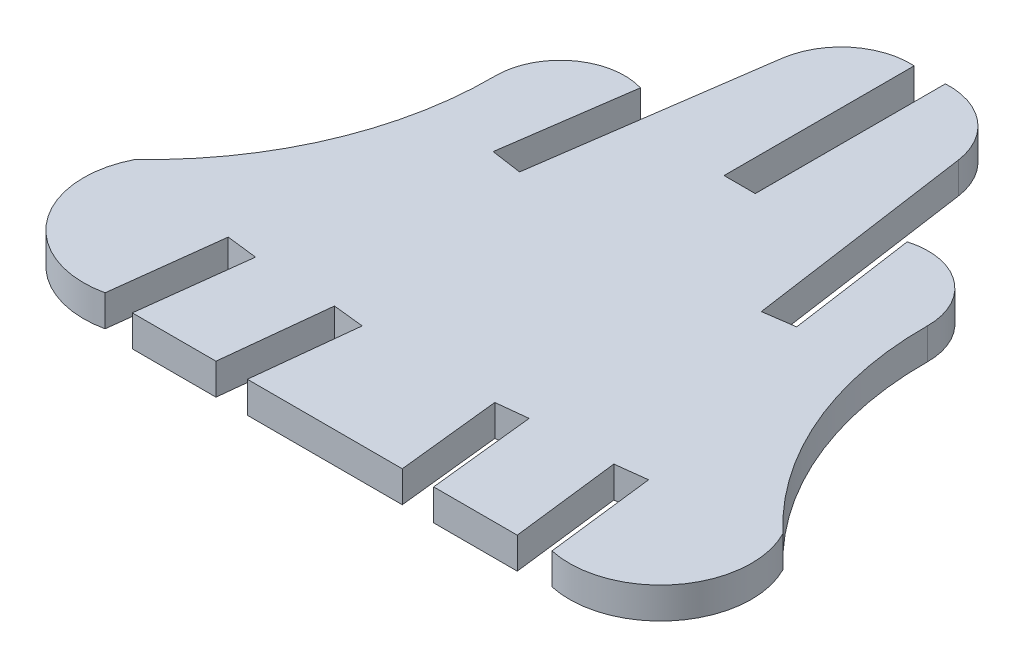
ISO-10303-21;
HEADER;
FILE_DESCRIPTION(('STEP AP214'),'2;1');
FILE_NAME('part.step','',(''),(''),'','','');
FILE_SCHEMA(('AUTOMOTIVE_DESIGN { 1 0 10303 214 1 1 1 1 }'));
ENDSEC;
DATA;
#1=APPLICATION_CONTEXT('core data for automotive mechanical design processes');
#2=APPLICATION_PROTOCOL_DEFINITION('international standard','automotive_design',2000,#1);
#3=PRODUCT_CONTEXT('',#1,'mechanical');
#4=PRODUCT('Part','Part','',(#3));
#5=PRODUCT_RELATED_PRODUCT_CATEGORY('part','',(#4));
#6=PRODUCT_DEFINITION_FORMATION('','',#4);
#7=PRODUCT_DEFINITION_CONTEXT('part definition',#1,'design');
#8=PRODUCT_DEFINITION('design','',#6,#7);
#9=PRODUCT_DEFINITION_SHAPE('','',#8);
#10=(LENGTH_UNIT() NAMED_UNIT(*) SI_UNIT(.MILLI.,.METRE.));
#11=(NAMED_UNIT(*) PLANE_ANGLE_UNIT() SI_UNIT($,.RADIAN.));
#12=(NAMED_UNIT(*) SI_UNIT($,.STERADIAN.) SOLID_ANGLE_UNIT());
#13=UNCERTAINTY_MEASURE_WITH_UNIT(LENGTH_MEASURE(1.E-05),#10,'distance_accuracy_value','');
#14=(GEOMETRIC_REPRESENTATION_CONTEXT(3) GLOBAL_UNCERTAINTY_ASSIGNED_CONTEXT((#13)) GLOBAL_UNIT_ASSIGNED_CONTEXT((#10,
#11,#12)) REPRESENTATION_CONTEXT('',''));
#15=CARTESIAN_POINT('',(0.,0.,0.));
#16=DIRECTION('',(0.,0.,1.));
#17=DIRECTION('',(1.,0.,0.));
#18=AXIS2_PLACEMENT_3D('',#15,#16,#17);
#19=CARTESIAN_POINT('',(-42106.1875,3.,-18178.298828));
#20=DIRECTION('',(-0.992772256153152,0.,0.120013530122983));
#21=DIRECTION('',(0.120013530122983,0.,0.992772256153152));
#22=AXIS2_PLACEMENT_3D('',#19,#20,#21);
#23=PLANE('',#22);
#24=DIRECTION('',(-0.120013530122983,0.,-0.992772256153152));
#25=VECTOR('',#24,1.);
#26=CARTESIAN_POINT('',(-42106.1875,0.,-18178.298828));
#27=LINE('',#26,#25);
#28=CARTESIAN_POINT('',(-42104.910156,0.,-18167.732422));
#29=VERTEX_POINT('',#28);
#30=CARTESIAN_POINT('',(-42106.1875,0.,-18178.298828));
#31=VERTEX_POINT('',#30);
#32=EDGE_CURVE('E276',#29,#31,#27,.T.);
#33=ORIENTED_EDGE('',*,*,#32,.T.);
#34=DIRECTION('',(0.,-1.,0.));
#35=VECTOR('',#34,1.);
#36=CARTESIAN_POINT('',(-42106.1875,3.,-18178.298828));
#37=LINE('',#36,#35);
#38=CARTESIAN_POINT('',(-42106.1875,3.,-18178.298828));
#39=VERTEX_POINT('',#38);
#40=EDGE_CURVE('E11',#39,#31,#37,.T.);
#41=ORIENTED_EDGE('',*,*,#40,.F.);
#42=DIRECTION('',(-0.120013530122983,0.,-0.992772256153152));
#43=VECTOR('',#42,1.);
#44=CARTESIAN_POINT('',(-42106.1875,3.,-18178.298828));
#45=LINE('',#44,#43);
#46=CARTESIAN_POINT('',(-42104.910156,3.,-18167.732422));
#47=VERTEX_POINT('',#46);
#48=EDGE_CURVE('E338',#47,#39,#45,.T.);
#49=ORIENTED_EDGE('',*,*,#48,.F.);
#50=DIRECTION('',(0.,-1.,0.));
#51=VECTOR('',#50,1.);
#52=CARTESIAN_POINT('',(-42104.910156,3.,-18167.732422));
#53=LINE('',#52,#51);
#54=EDGE_CURVE('E272',#47,#29,#53,.T.);
#55=ORIENTED_EDGE('',*,*,#54,.T.);
#56=EDGE_LOOP('',(#33,#41,#49,#55));
#57=FACE_BOUND('',#56,.T.);
#58=ADVANCED_FACE('F36',(#57),#23,.F.);
#59=CARTESIAN_POINT('',(-42103.207031,3.,-18178.660156));
#60=DIRECTION('',(-0.120350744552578,0.,-0.992731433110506));
#61=DIRECTION('',(-0.992731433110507,0.,0.120350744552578));
#62=AXIS2_PLACEMENT_3D('',#59,#60,#61);
#63=PLANE('',#62);
#64=DIRECTION('',(0.992731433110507,0.,-0.120350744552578));
#65=VECTOR('',#64,1.);
#66=CARTESIAN_POINT('',(-42103.207031,0.,-18178.660156));
#67=LINE('',#66,#65);
#68=CARTESIAN_POINT('',(-42103.207031,0.,-18178.660156));
#69=VERTEX_POINT('',#68);
#70=EDGE_CURVE('E279',#31,#69,#67,.T.);
#71=ORIENTED_EDGE('',*,*,#70,.T.);
#72=DIRECTION('',(0.,-1.,0.));
#73=VECTOR('',#72,1.);
#74=CARTESIAN_POINT('',(-42103.207031,3.,-18178.660156));
#75=LINE('',#74,#73);
#76=CARTESIAN_POINT('',(-42103.207031,3.,-18178.660156));
#77=VERTEX_POINT('',#76);
#78=EDGE_CURVE('E44',#77,#69,#75,.T.);
#79=ORIENTED_EDGE('',*,*,#78,.F.);
#80=DIRECTION('',(0.992731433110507,0.,-0.120350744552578));
#81=VECTOR('',#80,1.);
#82=CARTESIAN_POINT('',(-42103.207031,3.,-18178.660156));
#83=LINE('',#82,#81);
#84=EDGE_CURVE('E167',#39,#77,#83,.T.);
#85=ORIENTED_EDGE('',*,*,#84,.F.);
#86=ORIENTED_EDGE('',*,*,#40,.T.);
#87=EDGE_LOOP('',(#71,#79,#85,#86));
#88=FACE_BOUND('',#87,.T.);
#89=ADVANCED_FACE('F516',(#88),#63,.F.);
#90=CARTESIAN_POINT('',(-42101.930163,3.,-18168.091132));
#91=DIRECTION('',(0.992781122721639,0.,-0.119940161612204));
#92=DIRECTION('',(-0.119940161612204,0.,-0.992781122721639));
#93=AXIS2_PLACEMENT_3D('',#90,#91,#92);
#94=PLANE('',#93);
#95=DIRECTION('',(0.119940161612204,0.,0.992781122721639));
#96=VECTOR('',#95,1.);
#97=CARTESIAN_POINT('',(-42101.930163,0.,-18168.091132));
#98=LINE('',#97,#96);
#99=CARTESIAN_POINT('',(-42101.930163,0.,-18168.091132));
#100=VERTEX_POINT('',#99);
#101=EDGE_CURVE('E281',#69,#100,#98,.T.);
#102=ORIENTED_EDGE('',*,*,#101,.T.);
#103=DIRECTION('',(0.,-1.,0.));
#104=VECTOR('',#103,1.);
#105=CARTESIAN_POINT('',(-42101.930163,3.,-18168.091132));
#106=LINE('',#105,#104);
#107=CARTESIAN_POINT('',(-42101.930163,3.,-18168.091132));
#108=VERTEX_POINT('',#107);
#109=EDGE_CURVE('E417',#108,#100,#106,.T.);
#110=ORIENTED_EDGE('',*,*,#109,.F.);
#111=DIRECTION('',(0.119940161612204,0.,0.992781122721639));
#112=VECTOR('',#111,1.);
#113=CARTESIAN_POINT('',(-42101.930163,3.,-18168.091132));
#114=LINE('',#113,#112);
#115=EDGE_CURVE('E425',#77,#108,#114,.T.);
#116=ORIENTED_EDGE('',*,*,#115,.F.);
#117=ORIENTED_EDGE('',*,*,#78,.T.);
#118=EDGE_LOOP('',(#102,#110,#116,#117));
#119=FACE_BOUND('',#118,.T.);
#120=ADVANCED_FACE('F423',(#119),#94,.F.);
#121=CARTESIAN_POINT('',(-42100.0576006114,3.,-18176.6497267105));
#122=DIRECTION('',(0.,-1.,0.));
#123=DIRECTION('',(0.,0.,-1.));
#124=AXIS2_PLACEMENT_3D('',#121,#122,#123);
#125=CYLINDRICAL_SURFACE('',#124,8.76105206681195);
#126=CARTESIAN_POINT('',(-42100.0576006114,0.,-18176.6497267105));
#127=DIRECTION('',(0.,1.,0.));
#128=DIRECTION('',(0.,0.,1.));
#129=AXIS2_PLACEMENT_3D('',#126,#127,#128);
#130=CIRCLE('',#129,8.76105206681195);
#131=CARTESIAN_POINT('',(-42092.260597,0.,-18180.64507));
#132=VERTEX_POINT('',#131);
#133=EDGE_CURVE('E283',#100,#132,#130,.T.);
#134=ORIENTED_EDGE('',*,*,#133,.T.);
#135=DIRECTION('',(0.,-1.,0.));
#136=VECTOR('',#135,1.);
#137=CARTESIAN_POINT('',(-42092.260597,3.,-18180.64507));
#138=LINE('',#137,#136);
#139=CARTESIAN_POINT('',(-42092.260597,3.,-18180.64507));
#140=VERTEX_POINT('',#139);
#141=EDGE_CURVE('E414',#140,#132,#138,.T.);
#142=ORIENTED_EDGE('',*,*,#141,.F.);
#143=CARTESIAN_POINT('',(-42100.0576006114,3.,-18176.6497267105));
#144=DIRECTION('',(0.,1.,0.));
#145=DIRECTION('',(0.,0.,1.));
#146=AXIS2_PLACEMENT_3D('',#143,#144,#145);
#147=CIRCLE('',#146,8.76105206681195);
#148=EDGE_CURVE('E443',#108,#140,#147,.T.);
#149=ORIENTED_EDGE('',*,*,#148,.F.);
#150=ORIENTED_EDGE('',*,*,#109,.T.);
#151=EDGE_LOOP('',(#134,#142,#149,#150));
#152=FACE_BOUND('',#151,.T.);
#153=ADVANCED_FACE('F434',(#152),#125,.T.);
#154=CARTESIAN_POINT('',(-42069.653546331,3.,-18204.6414887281));
#155=DIRECTION('',(0.,-1.,0.));
#156=DIRECTION('',(0.,0.,-1.));
#157=AXIS2_PLACEMENT_3D('',#154,#155,#156);
#158=CYLINDRICAL_SURFACE('',#157,32.9682703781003);
#159=CARTESIAN_POINT('',(-42069.653546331,0.,-18204.6414887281));
#160=DIRECTION('',(0.,-1.,0.));
#161=DIRECTION('',(0.,0.,1.));
#162=AXIS2_PLACEMENT_3D('',#159,#160,#161);
#163=CIRCLE('',#162,32.9682703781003);
#164=CARTESIAN_POINT('',(-42102.620675,0.,-18204.915859));
#165=VERTEX_POINT('',#164);
#166=EDGE_CURVE('E285',#132,#165,#163,.T.);
#167=ORIENTED_EDGE('',*,*,#166,.T.);
#168=DIRECTION('',(0.,-1.,0.));
#169=VECTOR('',#168,1.);
#170=CARTESIAN_POINT('',(-42102.620675,3.,-18204.915859));
#171=LINE('',#170,#169);
#172=CARTESIAN_POINT('',(-42102.620675,3.,-18204.915859));
#173=VERTEX_POINT('',#172);
#174=EDGE_CURVE('E411',#173,#165,#171,.T.);
#175=ORIENTED_EDGE('',*,*,#174,.F.);
#176=CARTESIAN_POINT('',(-42069.653546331,3.,-18204.6414887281));
#177=DIRECTION('',(0.,-1.,0.));
#178=DIRECTION('',(0.,0.,1.));
#179=AXIS2_PLACEMENT_3D('',#176,#177,#178);
#180=CIRCLE('',#179,32.9682703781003);
#181=EDGE_CURVE('E440',#140,#173,#180,.T.);
#182=ORIENTED_EDGE('',*,*,#181,.F.);
#183=ORIENTED_EDGE('',*,*,#141,.T.);
#184=EDGE_LOOP('',(#167,#175,#182,#183));
#185=FACE_BOUND('',#184,.T.);
#186=ADVANCED_FACE('F438',(#185),#158,.F.);
#187=CARTESIAN_POINT('',(-42108.8242526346,3.,-18204.966822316));
#188=DIRECTION('',(0.,-1.,0.));
#189=DIRECTION('',(0.,0.,-1.));
#190=AXIS2_PLACEMENT_3D('',#187,#188,#189);
#191=CYLINDRICAL_SURFACE('',#190,6.20378696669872);
#192=CARTESIAN_POINT('',(-42108.8242526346,0.,-18204.966822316));
#193=DIRECTION('',(0.,1.,0.));
#194=DIRECTION('',(0.,0.,1.));
#195=AXIS2_PLACEMENT_3D('',#192,#193,#194);
#196=CIRCLE('',#195,6.20378696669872);
#197=CARTESIAN_POINT('',(-42110.589844,0.,-18210.914062));
#198=VERTEX_POINT('',#197);
#199=EDGE_CURVE('E287',#165,#198,#196,.T.);
#200=ORIENTED_EDGE('',*,*,#199,.T.);
#201=DIRECTION('',(0.,-1.,0.));
#202=VECTOR('',#201,1.);
#203=CARTESIAN_POINT('',(-42110.589844,3.,-18210.914062));
#204=LINE('',#203,#202);
#205=CARTESIAN_POINT('',(-42110.589844,3.,-18210.914062));
#206=VERTEX_POINT('',#205);
#207=EDGE_CURVE('E408',#206,#198,#204,.T.);
#208=ORIENTED_EDGE('',*,*,#207,.F.);
#209=CARTESIAN_POINT('',(-42108.8242526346,3.,-18204.966822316));
#210=DIRECTION('',(0.,1.,0.));
#211=DIRECTION('',(0.,0.,1.));
#212=AXIS2_PLACEMENT_3D('',#209,#210,#211);
#213=CIRCLE('',#212,6.20378696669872);
#214=EDGE_CURVE('E442',#173,#206,#213,.T.);
#215=ORIENTED_EDGE('',*,*,#214,.F.);
#216=ORIENTED_EDGE('',*,*,#174,.T.);
#217=EDGE_LOOP('',(#200,#208,#215,#216));
#218=FACE_BOUND('',#217,.T.);
#219=ADVANCED_FACE('F529',(#218),#191,.T.);
#220=CARTESIAN_POINT('',(-42108.820312,3.,-18198.515625));
#221=DIRECTION('',(0.989968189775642,0.,-0.141290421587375));
#222=DIRECTION('',(-0.141290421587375,0.,-0.989968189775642));
#223=AXIS2_PLACEMENT_3D('',#220,#221,#222);
#224=PLANE('',#223);
#225=DIRECTION('',(0.141290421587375,0.,0.989968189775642));
#226=VECTOR('',#225,1.);
#227=CARTESIAN_POINT('',(-42108.820312,0.,-18198.515625));
#228=LINE('',#227,#226);
#229=CARTESIAN_POINT('',(-42108.820312,0.,-18198.515625));
#230=VERTEX_POINT('',#229);
#231=EDGE_CURVE('E289',#198,#230,#228,.T.);
#232=ORIENTED_EDGE('',*,*,#231,.T.);
#233=DIRECTION('',(0.,-1.,0.));
#234=VECTOR('',#233,1.);
#235=CARTESIAN_POINT('',(-42108.820312,3.,-18198.515625));
#236=LINE('',#235,#234);
#237=CARTESIAN_POINT('',(-42108.820312,3.,-18198.515625));
#238=VERTEX_POINT('',#237);
#239=EDGE_CURVE('E405',#238,#230,#236,.T.);
#240=ORIENTED_EDGE('',*,*,#239,.F.);
#241=DIRECTION('',(0.141290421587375,0.,0.989968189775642));
#242=VECTOR('',#241,1.);
#243=CARTESIAN_POINT('',(-42108.820312,3.,-18198.515625));
#244=LINE('',#243,#242);
#245=EDGE_CURVE('E445',#206,#238,#244,.T.);
#246=ORIENTED_EDGE('',*,*,#245,.F.);
#247=ORIENTED_EDGE('',*,*,#207,.T.);
#248=EDGE_LOOP('',(#232,#240,#246,#247));
#249=FACE_BOUND('',#248,.T.);
#250=ADVANCED_FACE('F532',(#249),#224,.F.);
#251=CARTESIAN_POINT('',(-42111.792969,3.,-18198.091797));
#252=DIRECTION('',(0.141148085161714,0.,0.989988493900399));
#253=DIRECTION('',(0.9899884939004,0.,-0.141148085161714));
#254=AXIS2_PLACEMENT_3D('',#251,#252,#253);
#255=PLANE('',#254);
#256=DIRECTION('',(-0.9899884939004,0.,0.141148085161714));
#257=VECTOR('',#256,1.);
#258=CARTESIAN_POINT('',(-42111.792969,0.,-18198.091797));
#259=LINE('',#258,#257);
#260=CARTESIAN_POINT('',(-42111.792969,0.,-18198.091797));
#261=VERTEX_POINT('',#260);
#262=EDGE_CURVE('E291',#230,#261,#259,.T.);
#263=ORIENTED_EDGE('',*,*,#262,.T.);
#264=DIRECTION('',(0.,-1.,0.));
#265=VECTOR('',#264,1.);
#266=CARTESIAN_POINT('',(-42111.792969,3.,-18198.091797));
#267=LINE('',#266,#265);
#268=CARTESIAN_POINT('',(-42111.792969,3.,-18198.091797));
#269=VERTEX_POINT('',#268);
#270=EDGE_CURVE('E402',#269,#261,#267,.T.);
#271=ORIENTED_EDGE('',*,*,#270,.F.);
#272=DIRECTION('',(-0.9899884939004,0.,0.141148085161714));
#273=VECTOR('',#272,1.);
#274=CARTESIAN_POINT('',(-42111.792969,3.,-18198.091797));
#275=LINE('',#274,#273);
#276=EDGE_CURVE('E451',#238,#269,#275,.T.);
#277=ORIENTED_EDGE('',*,*,#276,.F.);
#278=ORIENTED_EDGE('',*,*,#239,.T.);
#279=EDGE_LOOP('',(#263,#271,#277,#278));
#280=FACE_BOUND('',#279,.T.);
#281=ADVANCED_FACE('F536',(#280),#255,.F.);
#282=CARTESIAN_POINT('',(-42114.939322,3.,-18220.18568));
#283=DIRECTION('',(-0.990011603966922,0.,0.14098590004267));
#284=DIRECTION('',(0.14098590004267,0.,0.990011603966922));
#285=AXIS2_PLACEMENT_3D('',#282,#283,#284);
#286=PLANE('',#285);
#287=DIRECTION('',(-0.14098590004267,0.,-0.990011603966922));
#288=VECTOR('',#287,1.);
#289=CARTESIAN_POINT('',(-42114.939322,0.,-18220.18568));
#290=LINE('',#289,#288);
#291=CARTESIAN_POINT('',(-42114.939322,0.,-18220.18568));
#292=VERTEX_POINT('',#291);
#293=EDGE_CURVE('E293',#261,#292,#290,.T.);
#294=ORIENTED_EDGE('',*,*,#293,.T.);
#295=DIRECTION('',(0.,-1.,0.));
#296=VECTOR('',#295,1.);
#297=CARTESIAN_POINT('',(-42114.939322,3.,-18220.18568));
#298=LINE('',#297,#296);
#299=CARTESIAN_POINT('',(-42114.939322,3.,-18220.18568));
#300=VERTEX_POINT('',#299);
#301=EDGE_CURVE('E399',#300,#292,#298,.T.);
#302=ORIENTED_EDGE('',*,*,#301,.F.);
#303=DIRECTION('',(-0.14098590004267,0.,-0.990011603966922));
#304=VECTOR('',#303,1.);
#305=CARTESIAN_POINT('',(-42114.939322,3.,-18220.18568));
#306=LINE('',#305,#304);
#307=EDGE_CURVE('E453',#269,#300,#306,.T.);
#308=ORIENTED_EDGE('',*,*,#307,.F.);
#309=ORIENTED_EDGE('',*,*,#270,.T.);
#310=EDGE_LOOP('',(#294,#302,#308,#309));
#311=FACE_BOUND('',#310,.T.);
#312=ADVANCED_FACE('F540',(#311),#286,.F.);
#313=CARTESIAN_POINT('',(-42121.5517199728,3.,-18219.2449121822));
#314=DIRECTION('',(0.,-1.,0.));
#315=DIRECTION('',(0.,0.,-1.));
#316=AXIS2_PLACEMENT_3D('',#313,#314,#315);
#317=CYLINDRICAL_SURFACE('',#316,6.67898577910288);
#318=CARTESIAN_POINT('',(-42121.5517199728,0.,-18219.2449121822));
#319=DIRECTION('',(0.,1.,0.));
#320=DIRECTION('',(0.,0.,1.));
#321=AXIS2_PLACEMENT_3D('',#318,#319,#320);
#322=CIRCLE('',#321,6.67898577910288);
#323=CARTESIAN_POINT('',(-42121.914062,0.,-18225.914062));
#324=VERTEX_POINT('',#323);
#325=EDGE_CURVE('E295',#292,#324,#322,.T.);
#326=ORIENTED_EDGE('',*,*,#325,.T.);
#327=DIRECTION('',(0.,-1.,0.));
#328=VECTOR('',#327,1.);
#329=CARTESIAN_POINT('',(-42121.914062,3.,-18225.914062));
#330=LINE('',#329,#328);
#331=CARTESIAN_POINT('',(-42121.914062,3.,-18225.914062));
#332=VERTEX_POINT('',#331);
#333=EDGE_CURVE('E396',#332,#324,#330,.T.);
#334=ORIENTED_EDGE('',*,*,#333,.F.);
#335=CARTESIAN_POINT('',(-42121.5517199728,3.,-18219.2449121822));
#336=DIRECTION('',(0.,1.,0.));
#337=DIRECTION('',(0.,0.,1.));
#338=AXIS2_PLACEMENT_3D('',#335,#336,#337);
#339=CIRCLE('',#338,6.67898577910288);
#340=EDGE_CURVE('E455',#300,#332,#339,.T.);
#341=ORIENTED_EDGE('',*,*,#340,.F.);
#342=ORIENTED_EDGE('',*,*,#301,.T.);
#343=EDGE_LOOP('',(#326,#334,#341,#342));
#344=FACE_BOUND('',#343,.T.);
#345=ADVANCED_FACE('F544',(#344),#317,.T.);
#346=CARTESIAN_POINT('',(-42121.914062,3.,-18207.628906));
#347=DIRECTION('',(1.,0.,-1.94294961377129E-12));
#348=DIRECTION('',(-1.94294961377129E-12,0.,-1.));
#349=AXIS2_PLACEMENT_3D('',#346,#347,#348);
#350=PLANE('',#349);
#351=DIRECTION('',(1.94294961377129E-12,0.,1.));
#352=VECTOR('',#351,1.);
#353=CARTESIAN_POINT('',(-42121.914062,0.,-18207.628906));
#354=LINE('',#353,#352);
#355=CARTESIAN_POINT('',(-42121.914062,0.,-18207.628906));
#356=VERTEX_POINT('',#355);
#357=EDGE_CURVE('E297',#324,#356,#354,.T.);
#358=ORIENTED_EDGE('',*,*,#357,.T.);
#359=DIRECTION('',(0.,-1.,0.));
#360=VECTOR('',#359,1.);
#361=CARTESIAN_POINT('',(-42121.914062,3.,-18207.628906));
#362=LINE('',#361,#360);
#363=CARTESIAN_POINT('',(-42121.914062,3.,-18207.628906));
#364=VERTEX_POINT('',#363);
#365=EDGE_CURVE('E393',#364,#356,#362,.T.);
#366=ORIENTED_EDGE('',*,*,#365,.F.);
#367=DIRECTION('',(1.94294961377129E-12,0.,1.));
#368=VECTOR('',#367,1.);
#369=CARTESIAN_POINT('',(-42121.914062,3.,-18207.628906));
#370=LINE('',#369,#368);
#371=EDGE_CURVE('E457',#332,#364,#370,.T.);
#372=ORIENTED_EDGE('',*,*,#371,.F.);
#373=ORIENTED_EDGE('',*,*,#333,.T.);
#374=EDGE_LOOP('',(#358,#366,#372,#373));
#375=FACE_BOUND('',#374,.T.);
#376=ADVANCED_FACE('F548',(#375),#350,.F.);
#377=CARTESIAN_POINT('',(-42124.917969,3.,-18207.628906));
#378=DIRECTION('',(0.,0.,1.));
#379=DIRECTION('',(1.,0.,0.));
#380=AXIS2_PLACEMENT_3D('',#377,#378,#379);
#381=PLANE('',#380);
#382=DIRECTION('',(-1.,0.,0.));
#383=VECTOR('',#382,1.);
#384=CARTESIAN_POINT('',(-42124.917969,0.,-18207.628906));
#385=LINE('',#384,#383);
#386=CARTESIAN_POINT('',(-42124.917969,0.,-18207.628906));
#387=VERTEX_POINT('',#386);
#388=EDGE_CURVE('E299',#356,#387,#385,.T.);
#389=ORIENTED_EDGE('',*,*,#388,.T.);
#390=DIRECTION('',(0.,-1.,0.));
#391=VECTOR('',#390,1.);
#392=CARTESIAN_POINT('',(-42124.917969,3.,-18207.628906));
#393=LINE('',#392,#391);
#394=CARTESIAN_POINT('',(-42124.917969,3.,-18207.628906));
#395=VERTEX_POINT('',#394);
#396=EDGE_CURVE('E390',#395,#387,#393,.T.);
#397=ORIENTED_EDGE('',*,*,#396,.F.);
#398=DIRECTION('',(-1.,0.,0.));
#399=VECTOR('',#398,1.);
#400=CARTESIAN_POINT('',(-42124.917969,3.,-18207.628906));
#401=LINE('',#400,#399);
#402=EDGE_CURVE('E459',#364,#395,#401,.T.);
#403=ORIENTED_EDGE('',*,*,#402,.F.);
#404=ORIENTED_EDGE('',*,*,#365,.T.);
#405=EDGE_LOOP('',(#389,#397,#403,#404));
#406=FACE_BOUND('',#405,.T.);
#407=ADVANCED_FACE('F552',(#406),#381,.F.);
#408=CARTESIAN_POINT('',(-42124.913957,3.,-18225.910244));
#409=DIRECTION('',(-0.999999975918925,0.,-0.000219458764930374));
#410=DIRECTION('',(-0.000219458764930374,0.,0.999999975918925));
#411=AXIS2_PLACEMENT_3D('',#408,#409,#410);
#412=PLANE('',#411);
#413=DIRECTION('',(0.000219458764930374,0.,-0.999999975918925));
#414=VECTOR('',#413,1.);
#415=CARTESIAN_POINT('',(-42124.913957,0.,-18225.910244));
#416=LINE('',#415,#414);
#417=CARTESIAN_POINT('',(-42124.913957,0.,-18225.910244));
#418=VERTEX_POINT('',#417);
#419=EDGE_CURVE('E301',#387,#418,#416,.T.);
#420=ORIENTED_EDGE('',*,*,#419,.T.);
#421=DIRECTION('',(0.,-1.,0.));
#422=VECTOR('',#421,1.);
#423=CARTESIAN_POINT('',(-42124.913957,3.,-18225.910244));
#424=LINE('',#423,#422);
#425=CARTESIAN_POINT('',(-42124.913957,3.,-18225.910244));
#426=VERTEX_POINT('',#425);
#427=EDGE_CURVE('E387',#426,#418,#424,.T.);
#428=ORIENTED_EDGE('',*,*,#427,.F.);
#429=DIRECTION('',(0.000219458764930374,0.,-0.999999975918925));
#430=VECTOR('',#429,1.);
#431=CARTESIAN_POINT('',(-42124.913957,3.,-18225.910244));
#432=LINE('',#431,#430);
#433=EDGE_CURVE('E461',#395,#426,#432,.T.);
#434=ORIENTED_EDGE('',*,*,#433,.F.);
#435=ORIENTED_EDGE('',*,*,#396,.T.);
#436=EDGE_LOOP('',(#420,#428,#434,#435));
#437=FACE_BOUND('',#436,.T.);
#438=ADVANCED_FACE('F556',(#437),#412,.F.);
#439=CARTESIAN_POINT('',(-42125.2848004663,3.,-18219.2392779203));
#440=DIRECTION('',(0.,-1.,0.));
#441=DIRECTION('',(0.,0.,-1.));
#442=AXIS2_PLACEMENT_3D('',#439,#440,#441);
#443=CYLINDRICAL_SURFACE('',#442,6.68126584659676);
#444=CARTESIAN_POINT('',(-42125.2848004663,0.,-18219.2392779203));
#445=DIRECTION('',(0.,1.,0.));
#446=DIRECTION('',(0.,0.,1.));
#447=AXIS2_PLACEMENT_3D('',#444,#445,#446);
#448=CIRCLE('',#447,6.68126584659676);
#449=CARTESIAN_POINT('',(-42131.898437,0.,-18220.1875));
#450=VERTEX_POINT('',#449);
#451=EDGE_CURVE('E303',#418,#450,#448,.T.);
#452=ORIENTED_EDGE('',*,*,#451,.T.);
#453=DIRECTION('',(0.,-1.,0.));
#454=VECTOR('',#453,1.);
#455=CARTESIAN_POINT('',(-42131.898437,3.,-18220.1875));
#456=LINE('',#455,#454);
#457=CARTESIAN_POINT('',(-42131.898437,3.,-18220.1875));
#458=VERTEX_POINT('',#457);
#459=EDGE_CURVE('E384',#458,#450,#456,.T.);
#460=ORIENTED_EDGE('',*,*,#459,.F.);
#461=CARTESIAN_POINT('',(-42125.2848004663,3.,-18219.2392779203));
#462=DIRECTION('',(0.,1.,0.));
#463=DIRECTION('',(0.,0.,1.));
#464=AXIS2_PLACEMENT_3D('',#461,#462,#463);
#465=CIRCLE('',#464,6.68126584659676);
#466=EDGE_CURVE('E463',#426,#458,#465,.T.);
#467=ORIENTED_EDGE('',*,*,#466,.F.);
#468=ORIENTED_EDGE('',*,*,#427,.T.);
#469=EDGE_LOOP('',(#452,#460,#467,#468));
#470=FACE_BOUND('',#469,.T.);
#471=ADVANCED_FACE('F560',(#470),#443,.T.);
#472=CARTESIAN_POINT('',(-42135.050781,3.,-18198.097656));
#473=DIRECTION('',(0.989970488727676,0.,0.14127431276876));
#474=DIRECTION('',(0.14127431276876,0.,-0.989970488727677));
#475=AXIS2_PLACEMENT_3D('',#472,#473,#474);
#476=PLANE('',#475);
#477=DIRECTION('',(-0.14127431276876,0.,0.989970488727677));
#478=VECTOR('',#477,1.);
#479=CARTESIAN_POINT('',(-42135.050781,0.,-18198.097656));
#480=LINE('',#479,#478);
#481=CARTESIAN_POINT('',(-42135.050781,0.,-18198.097656));
#482=VERTEX_POINT('',#481);
#483=EDGE_CURVE('E305',#450,#482,#480,.T.);
#484=ORIENTED_EDGE('',*,*,#483,.T.);
#485=DIRECTION('',(0.,-1.,0.));
#486=VECTOR('',#485,1.);
#487=CARTESIAN_POINT('',(-42135.050781,3.,-18198.097656));
#488=LINE('',#487,#486);
#489=CARTESIAN_POINT('',(-42135.050781,3.,-18198.097656));
#490=VERTEX_POINT('',#489);
#491=EDGE_CURVE('E381',#490,#482,#488,.T.);
#492=ORIENTED_EDGE('',*,*,#491,.F.);
#493=DIRECTION('',(-0.14127431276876,0.,0.989970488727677));
#494=VECTOR('',#493,1.);
#495=CARTESIAN_POINT('',(-42135.050781,3.,-18198.097656));
#496=LINE('',#495,#494);
#497=EDGE_CURVE('E465',#458,#490,#496,.T.);
#498=ORIENTED_EDGE('',*,*,#497,.F.);
#499=ORIENTED_EDGE('',*,*,#459,.T.);
#500=EDGE_LOOP('',(#484,#492,#498,#499));
#501=FACE_BOUND('',#500,.T.);
#502=ADVANCED_FACE('F564',(#501),#476,.F.);
#503=CARTESIAN_POINT('',(-42138.015625,3.,-18198.519531));
#504=DIRECTION('',(-0.14087348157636,0.,0.99002760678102));
#505=DIRECTION('',(0.990027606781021,0.,0.14087348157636));
#506=AXIS2_PLACEMENT_3D('',#503,#504,#505);
#507=PLANE('',#506);
#508=DIRECTION('',(-0.99002760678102,0.,-0.14087348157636));
#509=VECTOR('',#508,1.);
#510=CARTESIAN_POINT('',(-42138.015625,0.,-18198.519531));
#511=LINE('',#510,#509);
#512=CARTESIAN_POINT('',(-42138.015625,0.,-18198.519531));
#513=VERTEX_POINT('',#512);
#514=EDGE_CURVE('E307',#482,#513,#511,.T.);
#515=ORIENTED_EDGE('',*,*,#514,.T.);
#516=DIRECTION('',(0.,-1.,0.));
#517=VECTOR('',#516,1.);
#518=CARTESIAN_POINT('',(-42138.015625,3.,-18198.519531));
#519=LINE('',#518,#517);
#520=CARTESIAN_POINT('',(-42138.015625,3.,-18198.519531));
#521=VERTEX_POINT('',#520);
#522=EDGE_CURVE('E378',#521,#513,#519,.T.);
#523=ORIENTED_EDGE('',*,*,#522,.F.);
#524=DIRECTION('',(-0.99002760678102,0.,-0.14087348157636));
#525=VECTOR('',#524,1.);
#526=CARTESIAN_POINT('',(-42138.015625,3.,-18198.519531));
#527=LINE('',#526,#525);
#528=EDGE_CURVE('E467',#490,#521,#527,.T.);
#529=ORIENTED_EDGE('',*,*,#528,.F.);
#530=ORIENTED_EDGE('',*,*,#491,.T.);
#531=EDGE_LOOP('',(#515,#523,#529,#530));
#532=FACE_BOUND('',#531,.T.);
#533=ADVANCED_FACE('F568',(#532),#507,.F.);
#534=CARTESIAN_POINT('',(-42136.245428,3.,-18210.9165379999));
#535=DIRECTION('',(-0.989958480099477,0.,-0.141358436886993));
#536=DIRECTION('',(-0.141358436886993,0.,0.989958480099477));
#537=AXIS2_PLACEMENT_3D('',#534,#535,#536);
#538=PLANE('',#537);
#539=DIRECTION('',(0.141358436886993,0.,-0.989958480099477));
#540=VECTOR('',#539,1.);
#541=CARTESIAN_POINT('',(-42136.245428,0.,-18210.9165379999));
#542=LINE('',#541,#540);
#543=CARTESIAN_POINT('',(-42136.245428,0.,-18210.9165379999));
#544=VERTEX_POINT('',#543);
#545=EDGE_CURVE('E309',#513,#544,#542,.T.);
#546=ORIENTED_EDGE('',*,*,#545,.T.);
#547=DIRECTION('',(0.,-1.,0.));
#548=VECTOR('',#547,1.);
#549=CARTESIAN_POINT('',(-42136.245428,3.,-18210.9165379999));
#550=LINE('',#549,#548);
#551=CARTESIAN_POINT('',(-42136.245428,3.,-18210.9165379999));
#552=VERTEX_POINT('',#551);
#553=EDGE_CURVE('E375',#552,#544,#550,.T.);
#554=ORIENTED_EDGE('',*,*,#553,.F.);
#555=DIRECTION('',(0.141358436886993,0.,-0.989958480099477));
#556=VECTOR('',#555,1.);
#557=CARTESIAN_POINT('',(-42136.245428,3.,-18210.9165379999));
#558=LINE('',#557,#556);
#559=EDGE_CURVE('E469',#521,#552,#558,.T.);
#560=ORIENTED_EDGE('',*,*,#559,.F.);
#561=ORIENTED_EDGE('',*,*,#522,.T.);
#562=EDGE_LOOP('',(#546,#554,#560,#561));
#563=FACE_BOUND('',#562,.T.);
#564=ADVANCED_FACE('F572',(#563),#538,.F.);
#565=CARTESIAN_POINT('',(-42138.0148697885,3.,-18204.9712709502));
#566=DIRECTION('',(0.,-1.,0.));
#567=DIRECTION('',(0.,0.,-1.));
#568=AXIS2_PLACEMENT_3D('',#565,#566,#567);
#569=CYLINDRICAL_SURFACE('',#568,6.20299319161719);
#570=CARTESIAN_POINT('',(-42138.0148697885,0.,-18204.9712709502));
#571=DIRECTION('',(0.,1.,0.));
#572=DIRECTION('',(0.,0.,1.));
#573=AXIS2_PLACEMENT_3D('',#570,#571,#572);
#574=CIRCLE('',#573,6.20299319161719);
#575=CARTESIAN_POINT('',(-42144.21766,0.,-18204.9210900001));
#576=VERTEX_POINT('',#575);
#577=EDGE_CURVE('E311',#544,#576,#574,.T.);
#578=ORIENTED_EDGE('',*,*,#577,.T.);
#579=DIRECTION('',(0.,-1.,0.));
#580=VECTOR('',#579,1.);
#581=CARTESIAN_POINT('',(-42144.21766,3.,-18204.9210900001));
#582=LINE('',#581,#580);
#583=CARTESIAN_POINT('',(-42144.21766,3.,-18204.9210900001));
#584=VERTEX_POINT('',#583);
#585=EDGE_CURVE('E372',#584,#576,#582,.T.);
#586=ORIENTED_EDGE('',*,*,#585,.F.);
#587=CARTESIAN_POINT('',(-42138.0148697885,3.,-18204.9712709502));
#588=DIRECTION('',(0.,1.,0.));
#589=DIRECTION('',(0.,0.,1.));
#590=AXIS2_PLACEMENT_3D('',#587,#588,#589);
#591=CIRCLE('',#590,6.20299319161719);
#592=EDGE_CURVE('E471',#552,#584,#591,.T.);
#593=ORIENTED_EDGE('',*,*,#592,.F.);
#594=ORIENTED_EDGE('',*,*,#553,.T.);
#595=EDGE_LOOP('',(#578,#586,#593,#594));
#596=FACE_BOUND('',#595,.T.);
#597=ADVANCED_FACE('F576',(#596),#569,.T.);
#598=CARTESIAN_POINT('',(-42177.1833561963,3.,-18204.6509479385));
#599=DIRECTION('',(0.,-1.,0.));
#600=DIRECTION('',(0.,0.,-1.));
#601=AXIS2_PLACEMENT_3D('',#598,#599,#600);
#602=CYLINDRICAL_SURFACE('',#601,32.9668030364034);
#603=CARTESIAN_POINT('',(-42177.1833561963,0.,-18204.6509479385));
#604=DIRECTION('',(0.,-1.,0.));
#605=DIRECTION('',(0.,0.,1.));
#606=AXIS2_PLACEMENT_3D('',#603,#604,#605);
#607=CIRCLE('',#606,32.9668030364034);
#608=CARTESIAN_POINT('',(-42154.5795199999,0.,-18180.653517));
#609=VERTEX_POINT('',#608);
#610=EDGE_CURVE('E313',#576,#609,#607,.T.);
#611=ORIENTED_EDGE('',*,*,#610,.T.);
#612=DIRECTION('',(0.,-1.,0.));
#613=VECTOR('',#612,1.);
#614=CARTESIAN_POINT('',(-42154.5795199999,3.,-18180.653517));
#615=LINE('',#614,#613);
#616=CARTESIAN_POINT('',(-42154.5795199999,3.,-18180.653517));
#617=VERTEX_POINT('',#616);
#618=EDGE_CURVE('E369',#617,#609,#615,.T.);
#619=ORIENTED_EDGE('',*,*,#618,.F.);
#620=CARTESIAN_POINT('',(-42177.1833561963,3.,-18204.6509479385));
#621=DIRECTION('',(0.,-1.,0.));
#622=DIRECTION('',(0.,0.,1.));
#623=AXIS2_PLACEMENT_3D('',#620,#621,#622);
#624=CIRCLE('',#623,32.9668030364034);
#625=EDGE_CURVE('E473',#584,#617,#624,.T.);
#626=ORIENTED_EDGE('',*,*,#625,.F.);
#627=ORIENTED_EDGE('',*,*,#585,.T.);
#628=EDGE_LOOP('',(#611,#619,#626,#627));
#629=FACE_BOUND('',#628,.T.);
#630=ADVANCED_FACE('F580',(#629),#602,.F.);
#631=CARTESIAN_POINT('',(-42146.7850469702,3.,-18176.6561083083));
#632=DIRECTION('',(0.,-1.,0.));
#633=DIRECTION('',(0.,0.,-1.));
#634=AXIS2_PLACEMENT_3D('',#631,#632,#633);
#635=CYLINDRICAL_SURFACE('',#634,8.75974235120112);
#636=CARTESIAN_POINT('',(-42146.7850469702,0.,-18176.6561083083));
#637=DIRECTION('',(0.,1.,0.));
#638=DIRECTION('',(0.,0.,1.));
#639=AXIS2_PLACEMENT_3D('',#636,#637,#638);
#640=CIRCLE('',#639,8.75974235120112);
#641=CARTESIAN_POINT('',(-42144.917969,0.,-18168.0976560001));
#642=VERTEX_POINT('',#641);
#643=EDGE_CURVE('E315',#609,#642,#640,.T.);
#644=ORIENTED_EDGE('',*,*,#643,.T.);
#645=DIRECTION('',(0.,-1.,0.));
#646=VECTOR('',#645,1.);
#647=CARTESIAN_POINT('',(-42144.917969,3.,-18168.0976560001));
#648=LINE('',#647,#646);
#649=CARTESIAN_POINT('',(-42144.917969,3.,-18168.0976560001));
#650=VERTEX_POINT('',#649);
#651=EDGE_CURVE('E366',#650,#642,#648,.T.);
#652=ORIENTED_EDGE('',*,*,#651,.F.);
#653=CARTESIAN_POINT('',(-42146.7850469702,3.,-18176.6561083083));
#654=DIRECTION('',(0.,1.,0.));
#655=DIRECTION('',(0.,0.,1.));
#656=AXIS2_PLACEMENT_3D('',#653,#654,#655);
#657=CIRCLE('',#656,8.75974235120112);
#658=EDGE_CURVE('E475',#617,#650,#657,.T.);
#659=ORIENTED_EDGE('',*,*,#658,.F.);
#660=ORIENTED_EDGE('',*,*,#618,.T.);
#661=EDGE_LOOP('',(#644,#652,#659,#660));
#662=FACE_BOUND('',#661,.T.);
#663=ADVANCED_FACE('F584',(#662),#635,.T.);
#664=CARTESIAN_POINT('',(-42143.636719,3.,-18178.662109));
#665=DIRECTION('',(-0.992725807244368,0.,-0.120397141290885));
#666=DIRECTION('',(-0.120397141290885,0.,0.992725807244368));
#667=AXIS2_PLACEMENT_3D('',#664,#665,#666);
#668=PLANE('',#667);
#669=DIRECTION('',(0.120397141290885,0.,-0.992725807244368));
#670=VECTOR('',#669,1.);
#671=CARTESIAN_POINT('',(-42143.636719,0.,-18178.662109));
#672=LINE('',#671,#670);
#673=CARTESIAN_POINT('',(-42143.636719,0.,-18178.662109));
#674=VERTEX_POINT('',#673);
#675=EDGE_CURVE('E317',#642,#674,#672,.T.);
#676=ORIENTED_EDGE('',*,*,#675,.T.);
#677=DIRECTION('',(0.,-1.,0.));
#678=VECTOR('',#677,1.);
#679=CARTESIAN_POINT('',(-42143.636719,3.,-18178.662109));
#680=LINE('',#679,#678);
#681=CARTESIAN_POINT('',(-42143.636719,3.,-18178.662109));
#682=VERTEX_POINT('',#681);
#683=EDGE_CURVE('E363',#682,#674,#680,.T.);
#684=ORIENTED_EDGE('',*,*,#683,.F.);
#685=DIRECTION('',(0.120397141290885,0.,-0.992725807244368));
#686=VECTOR('',#685,1.);
#687=CARTESIAN_POINT('',(-42143.636719,3.,-18178.662109));
#688=LINE('',#687,#686);
#689=EDGE_CURVE('E477',#650,#682,#688,.T.);
#690=ORIENTED_EDGE('',*,*,#689,.F.);
#691=ORIENTED_EDGE('',*,*,#651,.T.);
#692=EDGE_LOOP('',(#676,#684,#690,#691));
#693=FACE_BOUND('',#692,.T.);
#694=ADVANCED_FACE('F588',(#693),#668,.F.);
#695=CARTESIAN_POINT('',(-42140.65625,3.,-18178.302734));
#696=DIRECTION('',(0.11970958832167,0.,-0.992808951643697));
#697=DIRECTION('',(-0.992808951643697,0.,-0.11970958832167));
#698=AXIS2_PLACEMENT_3D('',#695,#696,#697);
#699=PLANE('',#698);
#700=DIRECTION('',(0.992808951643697,0.,0.11970958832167));
#701=VECTOR('',#700,1.);
#702=CARTESIAN_POINT('',(-42140.65625,0.,-18178.302734));
#703=LINE('',#702,#701);
#704=CARTESIAN_POINT('',(-42140.65625,0.,-18178.302734));
#705=VERTEX_POINT('',#704);
#706=EDGE_CURVE('E319',#674,#705,#703,.T.);
#707=ORIENTED_EDGE('',*,*,#706,.T.);
#708=DIRECTION('',(0.,-1.,0.));
#709=VECTOR('',#708,1.);
#710=CARTESIAN_POINT('',(-42140.65625,3.,-18178.302734));
#711=LINE('',#710,#709);
#712=CARTESIAN_POINT('',(-42140.65625,3.,-18178.302734));
#713=VERTEX_POINT('',#712);
#714=EDGE_CURVE('E360',#713,#705,#711,.T.);
#715=ORIENTED_EDGE('',*,*,#714,.F.);
#716=DIRECTION('',(0.992808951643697,0.,0.11970958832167));
#717=VECTOR('',#716,1.);
#718=CARTESIAN_POINT('',(-42140.65625,3.,-18178.302734));
#719=LINE('',#718,#717);
#720=EDGE_CURVE('E479',#682,#713,#719,.T.);
#721=ORIENTED_EDGE('',*,*,#720,.F.);
#722=ORIENTED_EDGE('',*,*,#683,.T.);
#723=EDGE_LOOP('',(#707,#715,#721,#722));
#724=FACE_BOUND('',#723,.T.);
#725=ADVANCED_FACE('F592',(#724),#699,.F.);
#726=CARTESIAN_POINT('',(-42141.9375,3.,-18167.736328));
#727=DIRECTION('',(0.992728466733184,0.,0.120375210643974));
#728=DIRECTION('',(0.120375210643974,0.,-0.992728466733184));
#729=AXIS2_PLACEMENT_3D('',#726,#727,#728);
#730=PLANE('',#729);
#731=DIRECTION('',(-0.120375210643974,0.,0.992728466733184));
#732=VECTOR('',#731,1.);
#733=CARTESIAN_POINT('',(-42141.9375,0.,-18167.736328));
#734=LINE('',#733,#732);
#735=CARTESIAN_POINT('',(-42141.9375,0.,-18167.736328));
#736=VERTEX_POINT('',#735);
#737=EDGE_CURVE('E321',#705,#736,#734,.T.);
#738=ORIENTED_EDGE('',*,*,#737,.T.);
#739=DIRECTION('',(0.,-1.,0.));
#740=VECTOR('',#739,1.);
#741=CARTESIAN_POINT('',(-42141.9375,3.,-18167.736328));
#742=LINE('',#741,#740);
#743=CARTESIAN_POINT('',(-42141.9375,3.,-18167.736328));
#744=VERTEX_POINT('',#743);
#745=EDGE_CURVE('E357',#744,#736,#742,.T.);
#746=ORIENTED_EDGE('',*,*,#745,.F.);
#747=DIRECTION('',(-0.120375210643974,0.,0.992728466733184));
#748=VECTOR('',#747,1.);
#749=CARTESIAN_POINT('',(-42141.9375,3.,-18167.736328));
#750=LINE('',#749,#748);
#751=EDGE_CURVE('E481',#713,#744,#750,.T.);
#752=ORIENTED_EDGE('',*,*,#751,.F.);
#753=ORIENTED_EDGE('',*,*,#714,.T.);
#754=EDGE_LOOP('',(#738,#746,#752,#753));
#755=FACE_BOUND('',#754,.T.);
#756=ADVANCED_FACE('F596',(#755),#730,.F.);
#757=CARTESIAN_POINT('',(-42133.890625,3.,-18167.734375));
#758=DIRECTION('',(0.000242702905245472,0.,-0.999999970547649));
#759=DIRECTION('',(-0.999999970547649,0.,-0.000242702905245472));
#760=AXIS2_PLACEMENT_3D('',#757,#758,#759);
#761=PLANE('',#760);
#762=DIRECTION('',(0.999999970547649,0.,0.000242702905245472));
#763=VECTOR('',#762,1.);
#764=CARTESIAN_POINT('',(-42133.890625,0.,-18167.734375));
#765=LINE('',#764,#763);
#766=CARTESIAN_POINT('',(-42133.890625,0.,-18167.734375));
#767=VERTEX_POINT('',#766);
#768=EDGE_CURVE('E323',#736,#767,#765,.T.);
#769=ORIENTED_EDGE('',*,*,#768,.T.);
#770=DIRECTION('',(0.,-1.,0.));
#771=VECTOR('',#770,1.);
#772=CARTESIAN_POINT('',(-42133.890625,3.,-18167.734375));
#773=LINE('',#772,#771);
#774=CARTESIAN_POINT('',(-42133.890625,3.,-18167.734375));
#775=VERTEX_POINT('',#774);
#776=EDGE_CURVE('E354',#775,#767,#773,.T.);
#777=ORIENTED_EDGE('',*,*,#776,.F.);
#778=DIRECTION('',(0.999999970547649,0.,0.000242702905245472));
#779=VECTOR('',#778,1.);
#780=CARTESIAN_POINT('',(-42133.890625,3.,-18167.734375));
#781=LINE('',#780,#779);
#782=EDGE_CURVE('E483',#744,#775,#781,.T.);
#783=ORIENTED_EDGE('',*,*,#782,.F.);
#784=ORIENTED_EDGE('',*,*,#745,.T.);
#785=EDGE_LOOP('',(#769,#777,#783,#784));
#786=FACE_BOUND('',#785,.T.);
#787=ADVANCED_FACE('F600',(#786),#761,.F.);
#788=CARTESIAN_POINT('',(-42132.785156,3.,-18178.029297));
#789=DIRECTION('',(-0.994284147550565,0.,-0.106766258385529));
#790=DIRECTION('',(-0.106766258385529,0.,0.994284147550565));
#791=AXIS2_PLACEMENT_3D('',#788,#789,#790);
#792=PLANE('',#791);
#793=DIRECTION('',(0.106766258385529,0.,-0.994284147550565));
#794=VECTOR('',#793,1.);
#795=CARTESIAN_POINT('',(-42132.785156,0.,-18178.029297));
#796=LINE('',#795,#794);
#797=CARTESIAN_POINT('',(-42132.785156,0.,-18178.029297));
#798=VERTEX_POINT('',#797);
#799=EDGE_CURVE('E325',#767,#798,#796,.T.);
#800=ORIENTED_EDGE('',*,*,#799,.T.);
#801=DIRECTION('',(0.,-1.,0.));
#802=VECTOR('',#801,1.);
#803=CARTESIAN_POINT('',(-42132.785156,3.,-18178.029297));
#804=LINE('',#803,#802);
#805=CARTESIAN_POINT('',(-42132.785156,3.,-18178.029297));
#806=VERTEX_POINT('',#805);
#807=EDGE_CURVE('E351',#806,#798,#804,.T.);
#808=ORIENTED_EDGE('',*,*,#807,.F.);
#809=DIRECTION('',(0.106766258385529,0.,-0.994284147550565));
#810=VECTOR('',#809,1.);
#811=CARTESIAN_POINT('',(-42132.785156,3.,-18178.029297));
#812=LINE('',#811,#810);
#813=EDGE_CURVE('E485',#775,#806,#812,.T.);
#814=ORIENTED_EDGE('',*,*,#813,.F.);
#815=ORIENTED_EDGE('',*,*,#776,.T.);
#816=EDGE_LOOP('',(#800,#808,#814,#815));
#817=FACE_BOUND('',#816,.T.);
#818=ADVANCED_FACE('F604',(#817),#792,.F.);
#819=CARTESIAN_POINT('',(-42129.796875,3.,-18177.705078));
#820=DIRECTION('',(0.107863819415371,0.,-0.994165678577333));
#821=DIRECTION('',(-0.994165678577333,0.,-0.107863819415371));
#822=AXIS2_PLACEMENT_3D('',#819,#820,#821);
#823=PLANE('',#822);
#824=DIRECTION('',(0.994165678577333,0.,0.107863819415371));
#825=VECTOR('',#824,1.);
#826=CARTESIAN_POINT('',(-42129.796875,0.,-18177.705078));
#827=LINE('',#826,#825);
#828=CARTESIAN_POINT('',(-42129.796875,0.,-18177.705078));
#829=VERTEX_POINT('',#828);
#830=EDGE_CURVE('E327',#798,#829,#827,.T.);
#831=ORIENTED_EDGE('',*,*,#830,.T.);
#832=DIRECTION('',(0.,-1.,0.));
#833=VECTOR('',#832,1.);
#834=CARTESIAN_POINT('',(-42129.796875,3.,-18177.705078));
#835=LINE('',#834,#833);
#836=CARTESIAN_POINT('',(-42129.796875,3.,-18177.705078));
#837=VERTEX_POINT('',#836);
#838=EDGE_CURVE('E348',#837,#829,#835,.T.);
#839=ORIENTED_EDGE('',*,*,#838,.F.);
#840=DIRECTION('',(0.994165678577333,0.,0.107863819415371));
#841=VECTOR('',#840,1.);
#842=CARTESIAN_POINT('',(-42129.796875,3.,-18177.705078));
#843=LINE('',#842,#841);
#844=EDGE_CURVE('E487',#806,#837,#843,.T.);
#845=ORIENTED_EDGE('',*,*,#844,.F.);
#846=ORIENTED_EDGE('',*,*,#807,.T.);
#847=EDGE_LOOP('',(#831,#839,#845,#846));
#848=FACE_BOUND('',#847,.T.);
#849=ADVANCED_FACE('F608',(#848),#823,.F.);
#850=CARTESIAN_POINT('',(-42130.875,3.,-18167.738281));
#851=DIRECTION('',(0.994200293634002,0.,0.107544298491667));
#852=DIRECTION('',(0.107544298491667,0.,-0.994200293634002));
#853=AXIS2_PLACEMENT_3D('',#850,#851,#852);
#854=PLANE('',#853);
#855=DIRECTION('',(-0.107544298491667,0.,0.994200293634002));
#856=VECTOR('',#855,1.);
#857=CARTESIAN_POINT('',(-42130.875,0.,-18167.738281));
#858=LINE('',#857,#856);
#859=CARTESIAN_POINT('',(-42130.875,0.,-18167.738281));
#860=VERTEX_POINT('',#859);
#861=EDGE_CURVE('E329',#829,#860,#858,.T.);
#862=ORIENTED_EDGE('',*,*,#861,.T.);
#863=DIRECTION('',(0.,-1.,0.));
#864=VECTOR('',#863,1.);
#865=CARTESIAN_POINT('',(-42130.875,3.,-18167.738281));
#866=LINE('',#865,#864);
#867=CARTESIAN_POINT('',(-42130.875,3.,-18167.738281));
#868=VERTEX_POINT('',#867);
#869=EDGE_CURVE('E345',#868,#860,#866,.T.);
#870=ORIENTED_EDGE('',*,*,#869,.F.);
#871=DIRECTION('',(-0.107544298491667,0.,0.994200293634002));
#872=VECTOR('',#871,1.);
#873=CARTESIAN_POINT('',(-42130.875,3.,-18167.738281));
#874=LINE('',#873,#872);
#875=EDGE_CURVE('E489',#837,#868,#874,.T.);
#876=ORIENTED_EDGE('',*,*,#875,.F.);
#877=ORIENTED_EDGE('',*,*,#838,.T.);
#878=EDGE_LOOP('',(#862,#870,#876,#877));
#879=FACE_BOUND('',#878,.T.);
#880=ADVANCED_FACE('F612',(#879),#854,.F.);
#881=CARTESIAN_POINT('',(-42115.96875,3.,-18167.732422));
#882=DIRECTION('',(0.000393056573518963,0.,-0.999999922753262));
#883=DIRECTION('',(-0.999999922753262,0.,-0.000393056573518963));
#884=AXIS2_PLACEMENT_3D('',#881,#882,#883);
#885=PLANE('',#884);
#886=DIRECTION('',(0.999999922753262,0.,0.000393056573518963));
#887=VECTOR('',#886,1.);
#888=CARTESIAN_POINT('',(-42115.96875,0.,-18167.732422));
#889=LINE('',#888,#887);
#890=CARTESIAN_POINT('',(-42115.96875,0.,-18167.732422));
#891=VERTEX_POINT('',#890);
#892=EDGE_CURVE('E331',#860,#891,#889,.T.);
#893=ORIENTED_EDGE('',*,*,#892,.T.);
#894=DIRECTION('',(0.,-1.,0.));
#895=VECTOR('',#894,1.);
#896=CARTESIAN_POINT('',(-42115.96875,3.,-18167.732422));
#897=LINE('',#896,#895);
#898=CARTESIAN_POINT('',(-42115.96875,3.,-18167.732422));
#899=VERTEX_POINT('',#898);
#900=EDGE_CURVE('E342',#899,#891,#897,.T.);
#901=ORIENTED_EDGE('',*,*,#900,.F.);
#902=DIRECTION('',(0.999999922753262,0.,0.000393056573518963));
#903=VECTOR('',#902,1.);
#904=CARTESIAN_POINT('',(-42115.96875,3.,-18167.732422));
#905=LINE('',#904,#903);
#906=EDGE_CURVE('E491',#868,#899,#905,.T.);
#907=ORIENTED_EDGE('',*,*,#906,.F.);
#908=ORIENTED_EDGE('',*,*,#869,.T.);
#909=EDGE_LOOP('',(#893,#901,#907,#908));
#910=FACE_BOUND('',#909,.T.);
#911=ADVANCED_FACE('F497',(#910),#885,.F.);
#912=CARTESIAN_POINT('',(-42117.042969,3.,-18177.705078));
#913=DIRECTION('',(-0.994248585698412,0.,0.107096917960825));
#914=DIRECTION('',(0.107096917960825,0.,0.994248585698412));
#915=AXIS2_PLACEMENT_3D('',#912,#913,#914);
#916=PLANE('',#915);
#917=DIRECTION('',(-0.107096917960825,0.,-0.994248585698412));
#918=VECTOR('',#917,1.);
#919=CARTESIAN_POINT('',(-42117.042969,0.,-18177.705078));
#920=LINE('',#919,#918);
#921=CARTESIAN_POINT('',(-42117.042969,0.,-18177.705078));
#922=VERTEX_POINT('',#921);
#923=EDGE_CURVE('E333',#891,#922,#920,.T.);
#924=ORIENTED_EDGE('',*,*,#923,.T.);
#925=DIRECTION('',(0.,-1.,0.));
#926=VECTOR('',#925,1.);
#927=CARTESIAN_POINT('',(-42117.042969,3.,-18177.705078));
#928=LINE('',#927,#926);
#929=CARTESIAN_POINT('',(-42117.042969,3.,-18177.705078));
#930=VERTEX_POINT('',#929);
#931=EDGE_CURVE('E267',#930,#922,#928,.T.);
#932=ORIENTED_EDGE('',*,*,#931,.F.);
#933=DIRECTION('',(-0.107096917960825,0.,-0.994248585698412));
#934=VECTOR('',#933,1.);
#935=CARTESIAN_POINT('',(-42117.042969,3.,-18177.705078));
#936=LINE('',#935,#934);
#937=EDGE_CURVE('E258',#899,#930,#936,.T.);
#938=ORIENTED_EDGE('',*,*,#937,.F.);
#939=ORIENTED_EDGE('',*,*,#900,.T.);
#940=EDGE_LOOP('',(#924,#932,#938,#939));
#941=FACE_BOUND('',#940,.T.);
#942=ADVANCED_FACE('F501',(#941),#916,.F.);
#943=CARTESIAN_POINT('',(-42114.0625,3.,-18178.027344));
#944=DIRECTION('',(-0.107499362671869,0.,-0.994205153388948));
#945=DIRECTION('',(-0.994205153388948,0.,0.107499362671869));
#946=AXIS2_PLACEMENT_3D('',#943,#944,#945);
#947=PLANE('',#946);
#948=DIRECTION('',(0.994205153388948,0.,-0.107499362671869));
#949=VECTOR('',#948,1.);
#950=CARTESIAN_POINT('',(-42114.0625,0.,-18178.027344));
#951=LINE('',#950,#949);
#952=CARTESIAN_POINT('',(-42114.0625,0.,-18178.027344));
#953=VERTEX_POINT('',#952);
#954=EDGE_CURVE('E266',#922,#953,#951,.T.);
#955=ORIENTED_EDGE('',*,*,#954,.T.);
#956=DIRECTION('',(0.,-1.,0.));
#957=VECTOR('',#956,1.);
#958=CARTESIAN_POINT('',(-42114.0625,3.,-18178.027344));
#959=LINE('',#958,#957);
#960=CARTESIAN_POINT('',(-42114.0625,3.,-18178.027344));
#961=VERTEX_POINT('',#960);
#962=EDGE_CURVE('E263',#961,#953,#959,.T.);
#963=ORIENTED_EDGE('',*,*,#962,.F.);
#964=DIRECTION('',(0.994205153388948,0.,-0.107499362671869));
#965=VECTOR('',#964,1.);
#966=CARTESIAN_POINT('',(-42114.0625,3.,-18178.027344));
#967=LINE('',#966,#965);
#968=EDGE_CURVE('E252',#930,#961,#967,.T.);
#969=ORIENTED_EDGE('',*,*,#968,.F.);
#970=ORIENTED_EDGE('',*,*,#931,.T.);
#971=EDGE_LOOP('',(#955,#963,#969,#970));
#972=FACE_BOUND('',#971,.T.);
#973=ADVANCED_FACE('F264',(#972),#947,.F.);
#974=CARTESIAN_POINT('',(-42112.953125,3.,-18167.734375));
#975=DIRECTION('',(0.99424186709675,0.,-0.107159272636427));
#976=DIRECTION('',(-0.107159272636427,0.,-0.99424186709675));
#977=AXIS2_PLACEMENT_3D('',#974,#975,#976);
#978=PLANE('',#977);
#979=DIRECTION('',(0.107159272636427,0.,0.99424186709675));
#980=VECTOR('',#979,1.);
#981=CARTESIAN_POINT('',(-42112.953125,0.,-18167.734375));
#982=LINE('',#981,#980);
#983=CARTESIAN_POINT('',(-42112.953125,0.,-18167.734375));
#984=VERTEX_POINT('',#983);
#985=EDGE_CURVE('E153',#953,#984,#982,.T.);
#986=ORIENTED_EDGE('',*,*,#985,.T.);
#987=DIRECTION('',(0.,-1.,0.));
#988=VECTOR('',#987,1.);
#989=CARTESIAN_POINT('',(-42112.953125,3.,-18167.734375));
#990=LINE('',#989,#988);
#991=CARTESIAN_POINT('',(-42112.953125,3.,-18167.734375));
#992=VERTEX_POINT('',#991);
#993=EDGE_CURVE('E268',#992,#984,#990,.T.);
#994=ORIENTED_EDGE('',*,*,#993,.F.);
#995=DIRECTION('',(0.107159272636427,0.,0.99424186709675));
#996=VECTOR('',#995,1.);
#997=CARTESIAN_POINT('',(-42112.953125,3.,-18167.734375));
#998=LINE('',#997,#996);
#999=EDGE_CURVE('E256',#961,#992,#998,.T.);
#1000=ORIENTED_EDGE('',*,*,#999,.F.);
#1001=ORIENTED_EDGE('',*,*,#962,.T.);
#1002=EDGE_LOOP('',(#986,#994,#1000,#1001));
#1003=FACE_BOUND('',#1002,.T.);
#1004=ADVANCED_FACE('F270',(#1003),#978,.F.);
#1005=CARTESIAN_POINT('',(-42104.910156,3.,-18167.732422));
#1006=DIRECTION('',(0.000242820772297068,0.,-0.999999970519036));
#1007=DIRECTION('',(-0.999999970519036,0.,-0.000242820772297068));
#1008=AXIS2_PLACEMENT_3D('',#1005,#1006,#1007);
#1009=PLANE('',#1008);
#1010=DIRECTION('',(0.999999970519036,0.,0.000242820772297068));
#1011=VECTOR('',#1010,1.);
#1012=CARTESIAN_POINT('',(-42104.910156,0.,-18167.732422));
#1013=LINE('',#1012,#1011);
#1014=EDGE_CURVE('E159',#984,#29,#1013,.T.);
#1015=ORIENTED_EDGE('',*,*,#1014,.T.);
#1016=ORIENTED_EDGE('',*,*,#54,.F.);
#1017=DIRECTION('',(0.999999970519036,0.,0.000242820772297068));
#1018=VECTOR('',#1017,1.);
#1019=CARTESIAN_POINT('',(-42104.910156,3.,-18167.732422));
#1020=LINE('',#1019,#1018);
#1021=EDGE_CURVE('E52',#992,#47,#1020,.T.);
#1022=ORIENTED_EDGE('',*,*,#1021,.F.);
#1023=ORIENTED_EDGE('',*,*,#993,.T.);
#1024=EDGE_LOOP('',(#1015,#1016,#1022,#1023));
#1025=FACE_BOUND('',#1024,.T.);
#1026=ADVANCED_FACE('F505',(#1025),#1009,.F.);
#1027=CARTESIAN_POINT('',(-42146.7850469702,3.,-18176.6561083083));
#1028=DIRECTION('',(0.,1.,0.));
#1029=DIRECTION('',(0.,0.,1.));
#1030=AXIS2_PLACEMENT_3D('',#1027,#1028,#1029);
#1031=PLANE('',#1030);
#1032=ORIENTED_EDGE('',*,*,#48,.T.);
#1033=ORIENTED_EDGE('',*,*,#84,.T.);
#1034=ORIENTED_EDGE('',*,*,#115,.T.);
#1035=ORIENTED_EDGE('',*,*,#148,.T.);
#1036=ORIENTED_EDGE('',*,*,#181,.T.);
#1037=ORIENTED_EDGE('',*,*,#214,.T.);
#1038=ORIENTED_EDGE('',*,*,#245,.T.);
#1039=ORIENTED_EDGE('',*,*,#276,.T.);
#1040=ORIENTED_EDGE('',*,*,#307,.T.);
#1041=ORIENTED_EDGE('',*,*,#340,.T.);
#1042=ORIENTED_EDGE('',*,*,#371,.T.);
#1043=ORIENTED_EDGE('',*,*,#402,.T.);
#1044=ORIENTED_EDGE('',*,*,#433,.T.);
#1045=ORIENTED_EDGE('',*,*,#466,.T.);
#1046=ORIENTED_EDGE('',*,*,#497,.T.);
#1047=ORIENTED_EDGE('',*,*,#528,.T.);
#1048=ORIENTED_EDGE('',*,*,#559,.T.);
#1049=ORIENTED_EDGE('',*,*,#592,.T.);
#1050=ORIENTED_EDGE('',*,*,#625,.T.);
#1051=ORIENTED_EDGE('',*,*,#658,.T.);
#1052=ORIENTED_EDGE('',*,*,#689,.T.);
#1053=ORIENTED_EDGE('',*,*,#720,.T.);
#1054=ORIENTED_EDGE('',*,*,#751,.T.);
#1055=ORIENTED_EDGE('',*,*,#782,.T.);
#1056=ORIENTED_EDGE('',*,*,#813,.T.);
#1057=ORIENTED_EDGE('',*,*,#844,.T.);
#1058=ORIENTED_EDGE('',*,*,#875,.T.);
#1059=ORIENTED_EDGE('',*,*,#906,.T.);
#1060=ORIENTED_EDGE('',*,*,#937,.T.);
#1061=ORIENTED_EDGE('',*,*,#968,.T.);
#1062=ORIENTED_EDGE('',*,*,#999,.T.);
#1063=ORIENTED_EDGE('',*,*,#1021,.T.);
#1064=EDGE_LOOP('',(#1032,#1033,#1034,#1035,#1036,#1037,#1038,#1039,#1040,#1041,#1042,#1043,
#1044,#1045,#1046,#1047,#1048,#1049,#1050,#1051,#1052,#1053,#1054,#1055,#1056,#1057,#1058,#1059,
#1060,#1061,#1062,#1063));
#1065=FACE_BOUND('',#1064,.T.);
#1066=ADVANCED_FACE('F254',(#1065),#1031,.T.);
#1067=CARTESIAN_POINT('',(-42146.7850469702,0.,-18176.6561083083));
#1068=DIRECTION('',(0.,1.,0.));
#1069=DIRECTION('',(0.,0.,1.));
#1070=AXIS2_PLACEMENT_3D('',#1067,#1068,#1069);
#1071=PLANE('',#1070);
#1072=ORIENTED_EDGE('',*,*,#32,.F.);
#1073=ORIENTED_EDGE('',*,*,#1014,.F.);
#1074=ORIENTED_EDGE('',*,*,#985,.F.);
#1075=ORIENTED_EDGE('',*,*,#954,.F.);
#1076=ORIENTED_EDGE('',*,*,#923,.F.);
#1077=ORIENTED_EDGE('',*,*,#892,.F.);
#1078=ORIENTED_EDGE('',*,*,#861,.F.);
#1079=ORIENTED_EDGE('',*,*,#830,.F.);
#1080=ORIENTED_EDGE('',*,*,#799,.F.);
#1081=ORIENTED_EDGE('',*,*,#768,.F.);
#1082=ORIENTED_EDGE('',*,*,#737,.F.);
#1083=ORIENTED_EDGE('',*,*,#706,.F.);
#1084=ORIENTED_EDGE('',*,*,#675,.F.);
#1085=ORIENTED_EDGE('',*,*,#643,.F.);
#1086=ORIENTED_EDGE('',*,*,#610,.F.);
#1087=ORIENTED_EDGE('',*,*,#577,.F.);
#1088=ORIENTED_EDGE('',*,*,#545,.F.);
#1089=ORIENTED_EDGE('',*,*,#514,.F.);
#1090=ORIENTED_EDGE('',*,*,#483,.F.);
#1091=ORIENTED_EDGE('',*,*,#451,.F.);
#1092=ORIENTED_EDGE('',*,*,#419,.F.);
#1093=ORIENTED_EDGE('',*,*,#388,.F.);
#1094=ORIENTED_EDGE('',*,*,#357,.F.);
#1095=ORIENTED_EDGE('',*,*,#325,.F.);
#1096=ORIENTED_EDGE('',*,*,#293,.F.);
#1097=ORIENTED_EDGE('',*,*,#262,.F.);
#1098=ORIENTED_EDGE('',*,*,#231,.F.);
#1099=ORIENTED_EDGE('',*,*,#199,.F.);
#1100=ORIENTED_EDGE('',*,*,#166,.F.);
#1101=ORIENTED_EDGE('',*,*,#133,.F.);
#1102=ORIENTED_EDGE('',*,*,#101,.F.);
#1103=ORIENTED_EDGE('',*,*,#70,.F.);
#1104=EDGE_LOOP('',(#1072,#1073,#1074,#1075,#1076,#1077,#1078,#1079,#1080,#1081,#1082,#1083,
#1084,#1085,#1086,#1087,#1088,#1089,#1090,#1091,#1092,#1093,#1094,#1095,#1096,#1097,#1098,#1099,
#1100,#1101,#1102,#1103));
#1105=FACE_BOUND('',#1104,.T.);
#1106=ADVANCED_FACE('F429',(#1105),#1071,.F.);
#1107=CLOSED_SHELL('',(#58,#89,#120,#153,#186,#219,#250,#281,#312,#345,#376,#407,#438,#471,#502,
#533,#564,#597,#630,#663,#694,#725,#756,#787,#818,#849,#880,#911,#942,#973,#1004,#1026,#1066,#1106));
#1108=MANIFOLD_SOLID_BREP('B2',#1107);
#1109=ADVANCED_BREP_SHAPE_REPRESENTATION('',(#18,#1108),#14);
#1110=SHAPE_DEFINITION_REPRESENTATION(#9,#1109);
ENDSEC;
END-ISO-10303-21;
